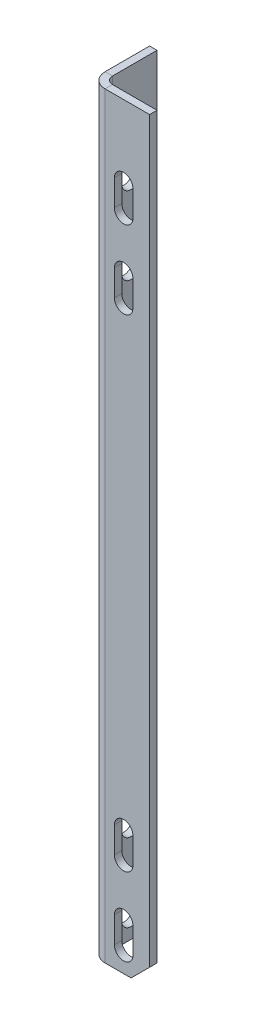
ISO-10303-21;
HEADER;
FILE_DESCRIPTION(('STEP AP214'),'2;1');
FILE_NAME('part.step','',(''),(''),'','','');
FILE_SCHEMA(('AUTOMOTIVE_DESIGN { 1 0 10303 214 1 1 1 1 }'));
ENDSEC;
DATA;
#1=APPLICATION_CONTEXT('core data for automotive mechanical design processes');
#2=APPLICATION_PROTOCOL_DEFINITION('international standard','automotive_design',2000,#1);
#3=PRODUCT_CONTEXT('',#1,'mechanical');
#4=PRODUCT('Part','Part','',(#3));
#5=PRODUCT_RELATED_PRODUCT_CATEGORY('part','',(#4));
#6=PRODUCT_DEFINITION_FORMATION('','',#4);
#7=PRODUCT_DEFINITION_CONTEXT('part definition',#1,'design');
#8=PRODUCT_DEFINITION('design','',#6,#7);
#9=PRODUCT_DEFINITION_SHAPE('','',#8);
#10=(LENGTH_UNIT() NAMED_UNIT(*) SI_UNIT(.MILLI.,.METRE.));
#11=(NAMED_UNIT(*) PLANE_ANGLE_UNIT() SI_UNIT($,.RADIAN.));
#12=(NAMED_UNIT(*) SI_UNIT($,.STERADIAN.) SOLID_ANGLE_UNIT());
#13=UNCERTAINTY_MEASURE_WITH_UNIT(LENGTH_MEASURE(1.E-05),#10,'distance_accuracy_value','');
#14=(GEOMETRIC_REPRESENTATION_CONTEXT(3) GLOBAL_UNCERTAINTY_ASSIGNED_CONTEXT((#13)) GLOBAL_UNIT_ASSIGNED_CONTEXT((#10,
#11,#12)) REPRESENTATION_CONTEXT('',''));
#15=CARTESIAN_POINT('',(0.,0.,0.));
#16=DIRECTION('',(0.,0.,1.));
#17=DIRECTION('',(1.,0.,0.));
#18=AXIS2_PLACEMENT_3D('',#15,#16,#17);
#19=CARTESIAN_POINT('',(0.,647.7,0.));
#20=DIRECTION('',(0.,0.,-1.));
#21=DIRECTION('',(-1.,0.,0.));
#22=AXIS2_PLACEMENT_3D('',#19,#20,#21);
#23=PLANE('',#22);
#24=CARTESIAN_POINT('',(28.575,496.8875,0.));
#25=DIRECTION('',(0.,0.,-1.));
#26=DIRECTION('',(-1.,0.,0.));
#27=AXIS2_PLACEMENT_3D('',#24,#25,#26);
#28=CIRCLE('',#27,7.9375);
#29=CARTESIAN_POINT('',(36.5125,496.8875,0.));
#30=VERTEX_POINT('',#29);
#31=CARTESIAN_POINT('',(20.6375,496.8875,0.));
#32=VERTEX_POINT('',#31);
#33=EDGE_CURVE('E455',#30,#32,#28,.T.);
#34=ORIENTED_EDGE('',*,*,#33,.T.);
#35=DIRECTION('',(0.,1.,0.));
#36=VECTOR('',#35,1.);
#37=CARTESIAN_POINT('',(20.6375,496.8875,0.));
#38=LINE('',#37,#36);
#39=CARTESIAN_POINT('',(20.6375,519.1125,0.));
#40=VERTEX_POINT('',#39);
#41=EDGE_CURVE('E458',#32,#40,#38,.T.);
#42=ORIENTED_EDGE('',*,*,#41,.T.);
#43=CARTESIAN_POINT('',(28.575,519.1125,0.));
#44=DIRECTION('',(0.,0.,-1.));
#45=DIRECTION('',(-1.,0.,0.));
#46=AXIS2_PLACEMENT_3D('',#43,#44,#45);
#47=CIRCLE('',#46,7.9375);
#48=CARTESIAN_POINT('',(36.5125,519.1125,0.));
#49=VERTEX_POINT('',#48);
#50=EDGE_CURVE('E461',#40,#49,#47,.T.);
#51=ORIENTED_EDGE('',*,*,#50,.T.);
#52=DIRECTION('',(0.,-1.,0.));
#53=VECTOR('',#52,1.);
#54=CARTESIAN_POINT('',(36.5125,496.8875,0.));
#55=LINE('',#54,#53);
#56=EDGE_CURVE('E464',#49,#30,#55,.T.);
#57=ORIENTED_EDGE('',*,*,#56,.T.);
#58=EDGE_LOOP('',(#34,#42,#51,#57));
#59=FACE_BOUND('',#58,.T.);
#60=CARTESIAN_POINT('',(28.575,84.1375,0.));
#61=DIRECTION('',(0.,0.,-1.));
#62=DIRECTION('',(-1.,0.,0.));
#63=AXIS2_PLACEMENT_3D('',#60,#61,#62);
#64=CIRCLE('',#63,7.9375);
#65=CARTESIAN_POINT('',(36.5125,84.1375000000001,0.));
#66=VERTEX_POINT('',#65);
#67=CARTESIAN_POINT('',(20.6375,84.1375,0.));
#68=VERTEX_POINT('',#67);
#69=EDGE_CURVE('E497',#66,#68,#64,.T.);
#70=ORIENTED_EDGE('',*,*,#69,.T.);
#71=DIRECTION('',(0.,1.,0.));
#72=VECTOR('',#71,1.);
#73=CARTESIAN_POINT('',(20.6375,84.1375,0.));
#74=LINE('',#73,#72);
#75=CARTESIAN_POINT('',(20.6375,106.3625,0.));
#76=VERTEX_POINT('',#75);
#77=EDGE_CURVE('E500',#68,#76,#74,.T.);
#78=ORIENTED_EDGE('',*,*,#77,.T.);
#79=CARTESIAN_POINT('',(28.575,106.3625,0.));
#80=DIRECTION('',(0.,0.,-1.));
#81=DIRECTION('',(-1.,0.,0.));
#82=AXIS2_PLACEMENT_3D('',#79,#80,#81);
#83=CIRCLE('',#82,7.9375);
#84=CARTESIAN_POINT('',(36.5125,106.3625,0.));
#85=VERTEX_POINT('',#84);
#86=EDGE_CURVE('E503',#76,#85,#83,.T.);
#87=ORIENTED_EDGE('',*,*,#86,.T.);
#88=DIRECTION('',(0.,-1.,0.));
#89=VECTOR('',#88,1.);
#90=CARTESIAN_POINT('',(36.5125,84.1375,0.));
#91=LINE('',#90,#89);
#92=EDGE_CURVE('E506',#85,#66,#91,.T.);
#93=ORIENTED_EDGE('',*,*,#92,.T.);
#94=EDGE_LOOP('',(#70,#78,#87,#93));
#95=FACE_BOUND('',#94,.T.);
#96=DIRECTION('',(1.,0.,0.));
#97=VECTOR('',#96,1.);
#98=CARTESIAN_POINT('',(0.,0.,0.));
#99=LINE('',#98,#97);
#100=CARTESIAN_POINT('',(12.7,0.,0.));
#101=VERTEX_POINT('',#100);
#102=CARTESIAN_POINT('',(34.925,0.,0.));
#103=VERTEX_POINT('',#102);
#104=EDGE_CURVE('E518',#101,#103,#99,.T.);
#105=ORIENTED_EDGE('',*,*,#104,.T.);
#106=DIRECTION('',(-0.707106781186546,-0.707106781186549,0.));
#107=VECTOR('',#106,1.);
#108=CARTESIAN_POINT('',(34.925,0.,0.));
#109=LINE('',#108,#107);
#110=CARTESIAN_POINT('',(50.8,15.8750000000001,0.));
#111=VERTEX_POINT('',#110);
#112=EDGE_CURVE('E639',#103,#111,#109,.F.);
#113=ORIENTED_EDGE('',*,*,#112,.T.);
#114=DIRECTION('',(0.,-1.,0.));
#115=VECTOR('',#114,1.);
#116=CARTESIAN_POINT('',(50.8,647.7,0.));
#117=LINE('',#116,#115);
#118=CARTESIAN_POINT('',(50.8,647.7,0.));
#119=VERTEX_POINT('',#118);
#120=EDGE_CURVE('E576',#119,#111,#117,.T.);
#121=ORIENTED_EDGE('',*,*,#120,.F.);
#122=DIRECTION('',(1.,0.,0.));
#123=VECTOR('',#122,1.);
#124=CARTESIAN_POINT('',(0.,647.7,0.));
#125=LINE('',#124,#123);
#126=CARTESIAN_POINT('',(12.7,647.7,0.));
#127=VERTEX_POINT('',#126);
#128=EDGE_CURVE('E519',#127,#119,#125,.T.);
#129=ORIENTED_EDGE('',*,*,#128,.F.);
#130=DIRECTION('',(0.,-1.,0.));
#131=VECTOR('',#130,1.);
#132=CARTESIAN_POINT('',(12.7,647.7,0.));
#133=LINE('',#132,#131);
#134=EDGE_CURVE('E543',#127,#101,#133,.T.);
#135=ORIENTED_EDGE('',*,*,#134,.T.);
#136=EDGE_LOOP('',(#105,#113,#121,#129,#135));
#137=FACE_BOUND('',#136,.T.);
#138=CARTESIAN_POINT('',(28.575,17.4625,0.));
#139=DIRECTION('',(0.,0.,-1.));
#140=DIRECTION('',(-1.,0.,0.));
#141=AXIS2_PLACEMENT_3D('',#138,#139,#140);
#142=CIRCLE('',#141,7.9375);
#143=CARTESIAN_POINT('',(36.5125,17.4625,0.));
#144=VERTEX_POINT('',#143);
#145=CARTESIAN_POINT('',(20.6375,17.4625,0.));
#146=VERTEX_POINT('',#145);
#147=EDGE_CURVE('E476',#144,#146,#142,.T.);
#148=ORIENTED_EDGE('',*,*,#147,.T.);
#149=DIRECTION('',(0.,1.,0.));
#150=VECTOR('',#149,1.);
#151=CARTESIAN_POINT('',(20.6375,17.4625,0.));
#152=LINE('',#151,#150);
#153=CARTESIAN_POINT('',(20.6375,39.6875,0.));
#154=VERTEX_POINT('',#153);
#155=EDGE_CURVE('E479',#146,#154,#152,.T.);
#156=ORIENTED_EDGE('',*,*,#155,.T.);
#157=CARTESIAN_POINT('',(28.575,39.6875,0.));
#158=DIRECTION('',(0.,0.,-1.));
#159=DIRECTION('',(-1.,0.,0.));
#160=AXIS2_PLACEMENT_3D('',#157,#158,#159);
#161=CIRCLE('',#160,7.9375);
#162=CARTESIAN_POINT('',(36.5125,39.6875,0.));
#163=VERTEX_POINT('',#162);
#164=EDGE_CURVE('E482',#154,#163,#161,.T.);
#165=ORIENTED_EDGE('',*,*,#164,.T.);
#166=DIRECTION('',(0.,-1.,0.));
#167=VECTOR('',#166,1.);
#168=CARTESIAN_POINT('',(36.5125,17.4625,0.));
#169=LINE('',#168,#167);
#170=EDGE_CURVE('E485',#163,#144,#169,.T.);
#171=ORIENTED_EDGE('',*,*,#170,.T.);
#172=EDGE_LOOP('',(#148,#156,#165,#171));
#173=FACE_BOUND('',#172,.T.);
#174=CARTESIAN_POINT('',(28.575,563.5625,0.));
#175=DIRECTION('',(0.,0.,-1.));
#176=DIRECTION('',(-1.,0.,0.));
#177=AXIS2_PLACEMENT_3D('',#174,#175,#176);
#178=CIRCLE('',#177,7.9375);
#179=CARTESIAN_POINT('',(36.5125,563.5625,0.));
#180=VERTEX_POINT('',#179);
#181=CARTESIAN_POINT('',(20.6375,563.5625,0.));
#182=VERTEX_POINT('',#181);
#183=EDGE_CURVE('E434',#180,#182,#178,.T.);
#184=ORIENTED_EDGE('',*,*,#183,.T.);
#185=DIRECTION('',(0.,1.,0.));
#186=VECTOR('',#185,1.);
#187=CARTESIAN_POINT('',(20.6375,563.5625,0.));
#188=LINE('',#187,#186);
#189=CARTESIAN_POINT('',(20.6375,585.7875,0.));
#190=VERTEX_POINT('',#189);
#191=EDGE_CURVE('E437',#182,#190,#188,.T.);
#192=ORIENTED_EDGE('',*,*,#191,.T.);
#193=CARTESIAN_POINT('',(28.575,585.7875,0.));
#194=DIRECTION('',(0.,0.,-1.));
#195=DIRECTION('',(-1.,0.,0.));
#196=AXIS2_PLACEMENT_3D('',#193,#194,#195);
#197=CIRCLE('',#196,7.9375);
#198=CARTESIAN_POINT('',(36.5125,585.7875,0.));
#199=VERTEX_POINT('',#198);
#200=EDGE_CURVE('E440',#190,#199,#197,.T.);
#201=ORIENTED_EDGE('',*,*,#200,.T.);
#202=DIRECTION('',(0.,-1.,0.));
#203=VECTOR('',#202,1.);
#204=CARTESIAN_POINT('',(36.5125,563.5625,0.));
#205=LINE('',#204,#203);
#206=EDGE_CURVE('E443',#199,#180,#205,.T.);
#207=ORIENTED_EDGE('',*,*,#206,.T.);
#208=EDGE_LOOP('',(#184,#192,#201,#207));
#209=FACE_BOUND('',#208,.T.);
#210=ADVANCED_FACE('F38',(#59,#95,#137,#173,#209),#23,.F.);
#211=CARTESIAN_POINT('',(0.,647.7,-6.35));
#212=DIRECTION('',(0.,0.,-1.));
#213=DIRECTION('',(-1.,0.,0.));
#214=AXIS2_PLACEMENT_3D('',#211,#212,#213);
#215=PLANE('',#214);
#216=DIRECTION('',(0.,-1.,0.));
#217=VECTOR('',#216,1.);
#218=CARTESIAN_POINT('',(20.6375,647.7,-6.35));
#219=LINE('',#218,#217);
#220=CARTESIAN_POINT('',(20.6375,519.1125,-6.35));
#221=VERTEX_POINT('',#220);
#222=CARTESIAN_POINT('',(20.6375,496.8875,-6.35));
#223=VERTEX_POINT('',#222);
#224=EDGE_CURVE('E618',#221,#223,#219,.T.);
#225=ORIENTED_EDGE('',*,*,#224,.T.);
#226=CARTESIAN_POINT('',(28.575,496.8875,-6.35));
#227=DIRECTION('',(0.,0.,-1.));
#228=DIRECTION('',(-1.,0.,0.));
#229=AXIS2_PLACEMENT_3D('',#226,#227,#228);
#230=CIRCLE('',#229,7.9375);
#231=CARTESIAN_POINT('',(36.5125,496.8875,-6.35));
#232=VERTEX_POINT('',#231);
#233=EDGE_CURVE('E621',#223,#232,#230,.F.);
#234=ORIENTED_EDGE('',*,*,#233,.T.);
#235=DIRECTION('',(0.,1.,0.));
#236=VECTOR('',#235,1.);
#237=CARTESIAN_POINT('',(36.5125,647.7,-6.35));
#238=LINE('',#237,#236);
#239=CARTESIAN_POINT('',(36.5125,519.1125,-6.35));
#240=VERTEX_POINT('',#239);
#241=EDGE_CURVE('E612',#232,#240,#238,.T.);
#242=ORIENTED_EDGE('',*,*,#241,.T.);
#243=CARTESIAN_POINT('',(28.575,519.1125,-6.35));
#244=DIRECTION('',(0.,0.,-1.));
#245=DIRECTION('',(-1.,0.,0.));
#246=AXIS2_PLACEMENT_3D('',#243,#244,#245);
#247=CIRCLE('',#246,7.9375);
#248=EDGE_CURVE('E615',#240,#221,#247,.F.);
#249=ORIENTED_EDGE('',*,*,#248,.T.);
#250=EDGE_LOOP('',(#225,#234,#242,#249));
#251=FACE_BOUND('',#250,.T.);
#252=DIRECTION('',(0.,-1.,0.));
#253=VECTOR('',#252,1.);
#254=CARTESIAN_POINT('',(20.6375,647.7,-6.35));
#255=LINE('',#254,#253);
#256=CARTESIAN_POINT('',(20.6375,106.3625,-6.35));
#257=VERTEX_POINT('',#256);
#258=CARTESIAN_POINT('',(20.6375,84.1375,-6.35));
#259=VERTEX_POINT('',#258);
#260=EDGE_CURVE('E594',#257,#259,#255,.T.);
#261=ORIENTED_EDGE('',*,*,#260,.T.);
#262=CARTESIAN_POINT('',(28.575,84.1375,-6.35));
#263=DIRECTION('',(0.,0.,-1.));
#264=DIRECTION('',(-1.,0.,0.));
#265=AXIS2_PLACEMENT_3D('',#262,#263,#264);
#266=CIRCLE('',#265,7.9375);
#267=CARTESIAN_POINT('',(36.5125,84.1375,-6.35));
#268=VERTEX_POINT('',#267);
#269=EDGE_CURVE('E597',#259,#268,#266,.F.);
#270=ORIENTED_EDGE('',*,*,#269,.T.);
#271=DIRECTION('',(0.,1.,0.));
#272=VECTOR('',#271,1.);
#273=CARTESIAN_POINT('',(36.5125,647.7,-6.35));
#274=LINE('',#273,#272);
#275=CARTESIAN_POINT('',(36.5125,106.3625,-6.35));
#276=VERTEX_POINT('',#275);
#277=EDGE_CURVE('E588',#268,#276,#274,.T.);
#278=ORIENTED_EDGE('',*,*,#277,.T.);
#279=CARTESIAN_POINT('',(28.575,106.3625,-6.35));
#280=DIRECTION('',(0.,0.,-1.));
#281=DIRECTION('',(-1.,0.,0.));
#282=AXIS2_PLACEMENT_3D('',#279,#280,#281);
#283=CIRCLE('',#282,7.9375);
#284=EDGE_CURVE('E591',#276,#257,#283,.F.);
#285=ORIENTED_EDGE('',*,*,#284,.T.);
#286=EDGE_LOOP('',(#261,#270,#278,#285));
#287=FACE_BOUND('',#286,.T.);
#288=DIRECTION('',(0.,-1.,0.));
#289=VECTOR('',#288,1.);
#290=CARTESIAN_POINT('',(50.8,647.7,-6.35));
#291=LINE('',#290,#289);
#292=CARTESIAN_POINT('',(50.8,647.7,-6.35));
#293=VERTEX_POINT('',#292);
#294=CARTESIAN_POINT('',(50.8,15.875,-6.35));
#295=VERTEX_POINT('',#294);
#296=EDGE_CURVE('E573',#293,#295,#291,.T.);
#297=ORIENTED_EDGE('',*,*,#296,.T.);
#298=DIRECTION('',(0.707106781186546,0.707106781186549,0.));
#299=VECTOR('',#298,1.);
#300=CARTESIAN_POINT('',(341.3125,306.387500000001,-6.35));
#301=LINE('',#300,#299);
#302=CARTESIAN_POINT('',(34.925,0.,-6.35));
#303=VERTEX_POINT('',#302);
#304=EDGE_CURVE('E643',#295,#303,#301,.F.);
#305=ORIENTED_EDGE('',*,*,#304,.T.);
#306=DIRECTION('',(1.,0.,0.));
#307=VECTOR('',#306,1.);
#308=CARTESIAN_POINT('',(0.,0.,-6.35));
#309=LINE('',#308,#307);
#310=CARTESIAN_POINT('',(12.7,0.,-6.35));
#311=VERTEX_POINT('',#310);
#312=EDGE_CURVE('E546',#311,#303,#309,.T.);
#313=ORIENTED_EDGE('',*,*,#312,.F.);
#314=DIRECTION('',(0.,-1.,0.));
#315=VECTOR('',#314,1.);
#316=CARTESIAN_POINT('',(12.7,647.7,-6.35));
#317=LINE('',#316,#315);
#318=CARTESIAN_POINT('',(12.7,647.7,-6.35));
#319=VERTEX_POINT('',#318);
#320=EDGE_CURVE('E570',#319,#311,#317,.T.);
#321=ORIENTED_EDGE('',*,*,#320,.F.);
#322=DIRECTION('',(1.,0.,0.));
#323=VECTOR('',#322,1.);
#324=CARTESIAN_POINT('',(0.,647.7,-6.35));
#325=LINE('',#324,#323);
#326=EDGE_CURVE('E525',#319,#293,#325,.T.);
#327=ORIENTED_EDGE('',*,*,#326,.T.);
#328=EDGE_LOOP('',(#297,#305,#313,#321,#327));
#329=FACE_BOUND('',#328,.T.);
#330=DIRECTION('',(0.,-1.,0.));
#331=VECTOR('',#330,1.);
#332=CARTESIAN_POINT('',(20.6375,647.7,-6.35));
#333=LINE('',#332,#331);
#334=CARTESIAN_POINT('',(20.6375,39.6875,-6.35));
#335=VERTEX_POINT('',#334);
#336=CARTESIAN_POINT('',(20.6375,17.4625,-6.35));
#337=VERTEX_POINT('',#336);
#338=EDGE_CURVE('E606',#335,#337,#333,.T.);
#339=ORIENTED_EDGE('',*,*,#338,.T.);
#340=CARTESIAN_POINT('',(28.575,17.4625,-6.35));
#341=DIRECTION('',(0.,0.,-1.));
#342=DIRECTION('',(-1.,0.,0.));
#343=AXIS2_PLACEMENT_3D('',#340,#341,#342);
#344=CIRCLE('',#343,7.9375);
#345=CARTESIAN_POINT('',(36.5125,17.4625,-6.35));
#346=VERTEX_POINT('',#345);
#347=EDGE_CURVE('E609',#337,#346,#344,.F.);
#348=ORIENTED_EDGE('',*,*,#347,.T.);
#349=DIRECTION('',(0.,1.,0.));
#350=VECTOR('',#349,1.);
#351=CARTESIAN_POINT('',(36.5125,647.7,-6.35));
#352=LINE('',#351,#350);
#353=CARTESIAN_POINT('',(36.5125,39.6875,-6.35));
#354=VERTEX_POINT('',#353);
#355=EDGE_CURVE('E600',#346,#354,#352,.T.);
#356=ORIENTED_EDGE('',*,*,#355,.T.);
#357=CARTESIAN_POINT('',(28.575,39.6875,-6.35));
#358=DIRECTION('',(0.,0.,-1.));
#359=DIRECTION('',(-1.,0.,0.));
#360=AXIS2_PLACEMENT_3D('',#357,#358,#359);
#361=CIRCLE('',#360,7.9375);
#362=EDGE_CURVE('E603',#354,#335,#361,.F.);
#363=ORIENTED_EDGE('',*,*,#362,.T.);
#364=EDGE_LOOP('',(#339,#348,#356,#363));
#365=FACE_BOUND('',#364,.T.);
#366=DIRECTION('',(0.,-1.,0.));
#367=VECTOR('',#366,1.);
#368=CARTESIAN_POINT('',(20.6375,647.7,-6.35));
#369=LINE('',#368,#367);
#370=CARTESIAN_POINT('',(20.6375,585.7875,-6.35));
#371=VERTEX_POINT('',#370);
#372=CARTESIAN_POINT('',(20.6375,563.5625,-6.35));
#373=VERTEX_POINT('',#372);
#374=EDGE_CURVE('E630',#371,#373,#369,.T.);
#375=ORIENTED_EDGE('',*,*,#374,.T.);
#376=CARTESIAN_POINT('',(28.575,563.5625,-6.35));
#377=DIRECTION('',(0.,0.,-1.));
#378=DIRECTION('',(-1.,0.,0.));
#379=AXIS2_PLACEMENT_3D('',#376,#377,#378);
#380=CIRCLE('',#379,7.9375);
#381=CARTESIAN_POINT('',(36.5125,563.5625,-6.35));
#382=VERTEX_POINT('',#381);
#383=EDGE_CURVE('E633',#373,#382,#380,.F.);
#384=ORIENTED_EDGE('',*,*,#383,.T.);
#385=DIRECTION('',(0.,1.,0.));
#386=VECTOR('',#385,1.);
#387=CARTESIAN_POINT('',(36.5125,647.7,-6.35));
#388=LINE('',#387,#386);
#389=CARTESIAN_POINT('',(36.5125,585.7875,-6.35));
#390=VERTEX_POINT('',#389);
#391=EDGE_CURVE('E624',#382,#390,#388,.T.);
#392=ORIENTED_EDGE('',*,*,#391,.T.);
#393=CARTESIAN_POINT('',(28.575,585.7875,-6.35));
#394=DIRECTION('',(0.,0.,-1.));
#395=DIRECTION('',(-1.,0.,0.));
#396=AXIS2_PLACEMENT_3D('',#393,#394,#395);
#397=CIRCLE('',#396,7.9375);
#398=EDGE_CURVE('E627',#390,#371,#397,.F.);
#399=ORIENTED_EDGE('',*,*,#398,.T.);
#400=EDGE_LOOP('',(#375,#384,#392,#399));
#401=FACE_BOUND('',#400,.T.);
#402=ADVANCED_FACE('F682',(#251,#287,#329,#365,#401),#215,.T.);
#403=CARTESIAN_POINT('',(0.,647.7,-12.7));
#404=DIRECTION('',(0.,1.,0.));
#405=DIRECTION('',(0.,0.,1.));
#406=AXIS2_PLACEMENT_3D('',#403,#404,#405);
#407=PLANE('',#406);
#408=DIRECTION('',(1.,0.,0.));
#409=VECTOR('',#408,1.);
#410=CARTESIAN_POINT('',(0.,647.7,-12.7));
#411=LINE('',#410,#409);
#412=CARTESIAN_POINT('',(0.,647.7,-12.7));
#413=VERTEX_POINT('',#412);
#414=CARTESIAN_POINT('',(6.35,647.7,-12.7));
#415=VERTEX_POINT('',#414);
#416=EDGE_CURVE('E586',#413,#415,#411,.T.);
#417=ORIENTED_EDGE('',*,*,#416,.F.);
#418=CARTESIAN_POINT('',(12.7,647.7,-12.7));
#419=DIRECTION('',(0.,-1.,0.));
#420=DIRECTION('',(0.,0.,-1.));
#421=AXIS2_PLACEMENT_3D('',#418,#419,#420);
#422=CIRCLE('',#421,12.7);
#423=EDGE_CURVE('E540',#413,#127,#422,.F.);
#424=ORIENTED_EDGE('',*,*,#423,.T.);
#425=DIRECTION('',(0.,0.,1.));
#426=VECTOR('',#425,1.);
#427=CARTESIAN_POINT('',(12.7,647.7,-6.35));
#428=LINE('',#427,#426);
#429=EDGE_CURVE('E584',#319,#127,#428,.T.);
#430=ORIENTED_EDGE('',*,*,#429,.F.);
#431=CARTESIAN_POINT('',(12.7,647.7,-12.7));
#432=DIRECTION('',(0.,1.,0.));
#433=DIRECTION('',(1.,0.,0.));
#434=AXIS2_PLACEMENT_3D('',#431,#432,#433);
#435=CIRCLE('',#434,6.35);
#436=EDGE_CURVE('E528',#415,#319,#435,.T.);
#437=ORIENTED_EDGE('',*,*,#436,.F.);
#438=EDGE_LOOP('',(#417,#424,#430,#437));
#439=FACE_BOUND('',#438,.T.);
#440=ADVANCED_FACE('F688',(#439),#407,.T.);
#441=CARTESIAN_POINT('',(12.7,647.7,-6.35));
#442=DIRECTION('',(0.,1.,0.));
#443=DIRECTION('',(0.,0.,1.));
#444=AXIS2_PLACEMENT_3D('',#441,#442,#443);
#445=PLANE('',#444);
#446=DIRECTION('',(0.,0.,1.));
#447=VECTOR('',#446,1.);
#448=CARTESIAN_POINT('',(0.,647.7,0.));
#449=LINE('',#448,#447);
#450=CARTESIAN_POINT('',(0.,647.7,-50.8));
#451=VERTEX_POINT('',#450);
#452=EDGE_CURVE('E537',#451,#413,#449,.T.);
#453=ORIENTED_EDGE('',*,*,#452,.T.);
#454=ORIENTED_EDGE('',*,*,#416,.T.);
#455=DIRECTION('',(0.,0.,-1.));
#456=VECTOR('',#455,1.);
#457=CARTESIAN_POINT('',(6.35,647.7,0.));
#458=LINE('',#457,#456);
#459=CARTESIAN_POINT('',(6.35,647.7,-50.8));
#460=VERTEX_POINT('',#459);
#461=EDGE_CURVE('E531',#460,#415,#458,.F.);
#462=ORIENTED_EDGE('',*,*,#461,.F.);
#463=DIRECTION('',(1.,0.,0.));
#464=VECTOR('',#463,1.);
#465=CARTESIAN_POINT('',(0.,647.7,-50.8));
#466=LINE('',#465,#464);
#467=EDGE_CURVE('E534',#451,#460,#466,.T.);
#468=ORIENTED_EDGE('',*,*,#467,.F.);
#469=EDGE_LOOP('',(#453,#454,#462,#468));
#470=FACE_BOUND('',#469,.T.);
#471=ADVANCED_FACE('F701',(#470),#445,.T.);
#472=CARTESIAN_POINT('',(12.7,0.,0.));
#473=DIRECTION('',(0.,-1.,0.));
#474=DIRECTION('',(0.,0.,-1.));
#475=AXIS2_PLACEMENT_3D('',#472,#473,#474);
#476=PLANE('',#475);
#477=DIRECTION('',(0.,0.,-1.));
#478=VECTOR('',#477,1.);
#479=CARTESIAN_POINT('',(12.7,0.,0.));
#480=LINE('',#479,#478);
#481=EDGE_CURVE('E582',#101,#311,#480,.T.);
#482=ORIENTED_EDGE('',*,*,#481,.F.);
#483=CARTESIAN_POINT('',(12.7,0.,-12.7));
#484=DIRECTION('',(0.,-1.,0.));
#485=DIRECTION('',(0.,0.,-1.));
#486=AXIS2_PLACEMENT_3D('',#483,#484,#485);
#487=CIRCLE('',#486,12.7);
#488=CARTESIAN_POINT('',(0.,0.,-12.7));
#489=VERTEX_POINT('',#488);
#490=EDGE_CURVE('E522',#489,#101,#487,.F.);
#491=ORIENTED_EDGE('',*,*,#490,.F.);
#492=DIRECTION('',(-1.,0.,0.));
#493=VECTOR('',#492,1.);
#494=CARTESIAN_POINT('',(6.35,0.,-12.7));
#495=LINE('',#494,#493);
#496=CARTESIAN_POINT('',(6.35,0.,-12.7));
#497=VERTEX_POINT('',#496);
#498=EDGE_CURVE('E579',#497,#489,#495,.T.);
#499=ORIENTED_EDGE('',*,*,#498,.F.);
#500=CARTESIAN_POINT('',(12.7,0.,-12.7));
#501=DIRECTION('',(0.,1.,0.));
#502=DIRECTION('',(1.,0.,0.));
#503=AXIS2_PLACEMENT_3D('',#500,#501,#502);
#504=CIRCLE('',#503,6.35);
#505=EDGE_CURVE('E549',#497,#311,#504,.T.);
#506=ORIENTED_EDGE('',*,*,#505,.T.);
#507=EDGE_LOOP('',(#482,#491,#499,#506));
#508=FACE_BOUND('',#507,.T.);
#509=ADVANCED_FACE('F665',(#508),#476,.T.);
#510=CARTESIAN_POINT('',(6.35,0.,-12.7));
#511=DIRECTION('',(0.,-1.,0.));
#512=DIRECTION('',(0.,0.,-1.));
#513=AXIS2_PLACEMENT_3D('',#510,#511,#512);
#514=PLANE('',#513);
#515=ORIENTED_EDGE('',*,*,#312,.T.);
#516=DIRECTION('',(0.,0.,1.));
#517=VECTOR('',#516,1.);
#518=CARTESIAN_POINT('',(34.925,0.,-12.7));
#519=LINE('',#518,#517);
#520=EDGE_CURVE('E636',#303,#103,#519,.T.);
#521=ORIENTED_EDGE('',*,*,#520,.T.);
#522=ORIENTED_EDGE('',*,*,#104,.F.);
#523=ORIENTED_EDGE('',*,*,#481,.T.);
#524=EDGE_LOOP('',(#515,#521,#522,#523));
#525=FACE_BOUND('',#524,.T.);
#526=ADVANCED_FACE('F695',(#525),#514,.T.);
#527=CARTESIAN_POINT('',(50.8,647.7,-6.35));
#528=DIRECTION('',(1.,0.,0.));
#529=DIRECTION('',(0.,0.,-1.));
#530=AXIS2_PLACEMENT_3D('',#527,#528,#529);
#531=PLANE('',#530);
#532=ORIENTED_EDGE('',*,*,#120,.T.);
#533=DIRECTION('',(0.,0.,-1.));
#534=VECTOR('',#533,1.);
#535=CARTESIAN_POINT('',(50.8,15.8750000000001,-6.35));
#536=LINE('',#535,#534);
#537=EDGE_CURVE('E641',#111,#295,#536,.T.);
#538=ORIENTED_EDGE('',*,*,#537,.T.);
#539=ORIENTED_EDGE('',*,*,#296,.F.);
#540=DIRECTION('',(0.,0.,1.));
#541=VECTOR('',#540,1.);
#542=CARTESIAN_POINT('',(50.8,647.7,-6.35));
#543=LINE('',#542,#541);
#544=EDGE_CURVE('E521',#293,#119,#543,.T.);
#545=ORIENTED_EDGE('',*,*,#544,.T.);
#546=EDGE_LOOP('',(#532,#538,#539,#545));
#547=FACE_BOUND('',#546,.T.);
#548=ADVANCED_FACE('F694',(#547),#531,.T.);
#549=CARTESIAN_POINT('',(12.7,647.7,-12.7));
#550=DIRECTION('',(0.,-1.,0.));
#551=DIRECTION('',(0.,0.,-1.));
#552=AXIS2_PLACEMENT_3D('',#549,#550,#551);
#553=CYLINDRICAL_SURFACE('',#552,6.35);
#554=ORIENTED_EDGE('',*,*,#505,.F.);
#555=DIRECTION('',(0.,-1.,0.));
#556=VECTOR('',#555,1.);
#557=CARTESIAN_POINT('',(6.35,647.7,-12.7));
#558=LINE('',#557,#556);
#559=EDGE_CURVE('E567',#415,#497,#558,.T.);
#560=ORIENTED_EDGE('',*,*,#559,.F.);
#561=ORIENTED_EDGE('',*,*,#436,.T.);
#562=ORIENTED_EDGE('',*,*,#320,.T.);
#563=EDGE_LOOP('',(#554,#560,#561,#562));
#564=FACE_BOUND('',#563,.T.);
#565=ADVANCED_FACE('F661',(#564),#553,.F.);
#566=CARTESIAN_POINT('',(6.35,647.7,0.));
#567=DIRECTION('',(1.,0.,0.));
#568=DIRECTION('',(0.,0.,-1.));
#569=AXIS2_PLACEMENT_3D('',#566,#567,#568);
#570=PLANE('',#569);
#571=CARTESIAN_POINT('',(6.35,519.1125,-28.575));
#572=DIRECTION('',(1.,0.,0.));
#573=DIRECTION('',(0.,0.,-1.));
#574=AXIS2_PLACEMENT_3D('',#571,#572,#573);
#575=CIRCLE('',#574,7.93750000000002);
#576=CARTESIAN_POINT('',(6.35,519.1125,-36.5125));
#577=VERTEX_POINT('',#576);
#578=CARTESIAN_POINT('',(6.35,519.1125,-20.6375));
#579=VERTEX_POINT('',#578);
#580=EDGE_CURVE('E345',#577,#579,#575,.T.);
#581=ORIENTED_EDGE('',*,*,#580,.F.);
#582=DIRECTION('',(0.,1.,0.));
#583=VECTOR('',#582,1.);
#584=CARTESIAN_POINT('',(6.35,647.7,-36.5125000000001));
#585=LINE('',#584,#583);
#586=CARTESIAN_POINT('',(6.35,496.8875,-36.5125));
#587=VERTEX_POINT('',#586);
#588=EDGE_CURVE('E338',#587,#577,#585,.T.);
#589=ORIENTED_EDGE('',*,*,#588,.F.);
#590=CARTESIAN_POINT('',(6.35,496.8875,-28.575));
#591=DIRECTION('',(1.,0.,0.));
#592=DIRECTION('',(0.,0.,-1.));
#593=AXIS2_PLACEMENT_3D('',#590,#591,#592);
#594=CIRCLE('',#593,7.9375);
#595=CARTESIAN_POINT('',(6.35,496.8875,-20.6375));
#596=VERTEX_POINT('',#595);
#597=EDGE_CURVE('E313',#596,#587,#594,.T.);
#598=ORIENTED_EDGE('',*,*,#597,.F.);
#599=DIRECTION('',(0.,-1.,0.));
#600=VECTOR('',#599,1.);
#601=CARTESIAN_POINT('',(6.35,647.7,-20.6374999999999));
#602=LINE('',#601,#600);
#603=EDGE_CURVE('E343',#579,#596,#602,.T.);
#604=ORIENTED_EDGE('',*,*,#603,.F.);
#605=EDGE_LOOP('',(#581,#589,#598,#604));
#606=FACE_BOUND('',#605,.T.);
#607=CARTESIAN_POINT('',(6.35,585.7875,-28.575));
#608=DIRECTION('',(1.,0.,0.));
#609=DIRECTION('',(0.,0.,-1.));
#610=AXIS2_PLACEMENT_3D('',#607,#608,#609);
#611=CIRCLE('',#610,7.93750000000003);
#612=CARTESIAN_POINT('',(6.35,585.7875,-36.5125));
#613=VERTEX_POINT('',#612);
#614=CARTESIAN_POINT('',(6.35,585.7875,-20.6375));
#615=VERTEX_POINT('',#614);
#616=EDGE_CURVE('E374',#613,#615,#611,.T.);
#617=ORIENTED_EDGE('',*,*,#616,.F.);
#618=DIRECTION('',(0.,1.,0.));
#619=VECTOR('',#618,1.);
#620=CARTESIAN_POINT('',(6.35,647.7,-36.5125000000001));
#621=LINE('',#620,#619);
#622=CARTESIAN_POINT('',(6.35,563.5625,-36.5125));
#623=VERTEX_POINT('',#622);
#624=EDGE_CURVE('E361',#623,#613,#621,.T.);
#625=ORIENTED_EDGE('',*,*,#624,.F.);
#626=CARTESIAN_POINT('',(6.35,563.5625,-28.575));
#627=DIRECTION('',(1.,0.,0.));
#628=DIRECTION('',(0.,0.,-1.));
#629=AXIS2_PLACEMENT_3D('',#626,#627,#628);
#630=CIRCLE('',#629,7.93750000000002);
#631=CARTESIAN_POINT('',(6.35,563.5625,-20.6375));
#632=VERTEX_POINT('',#631);
#633=EDGE_CURVE('E369',#632,#623,#630,.T.);
#634=ORIENTED_EDGE('',*,*,#633,.F.);
#635=DIRECTION('',(0.,-1.,0.));
#636=VECTOR('',#635,1.);
#637=CARTESIAN_POINT('',(6.35,647.7,-20.6374999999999));
#638=LINE('',#637,#636);
#639=EDGE_CURVE('E372',#615,#632,#638,.T.);
#640=ORIENTED_EDGE('',*,*,#639,.F.);
#641=EDGE_LOOP('',(#617,#625,#634,#640));
#642=FACE_BOUND('',#641,.T.);
#643=CARTESIAN_POINT('',(6.35,84.1375,-28.575));
#644=DIRECTION('',(1.,0.,0.));
#645=DIRECTION('',(0.,0.,-1.));
#646=AXIS2_PLACEMENT_3D('',#643,#644,#645);
#647=CIRCLE('',#646,7.9375);
#648=CARTESIAN_POINT('',(6.35,84.1374999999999,-20.6375));
#649=VERTEX_POINT('',#648);
#650=CARTESIAN_POINT('',(6.35,84.1374999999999,-36.5125));
#651=VERTEX_POINT('',#650);
#652=EDGE_CURVE('E403',#649,#651,#647,.T.);
#653=ORIENTED_EDGE('',*,*,#652,.F.);
#654=DIRECTION('',(0.,-1.,0.));
#655=VECTOR('',#654,1.);
#656=CARTESIAN_POINT('',(6.35,647.7,-20.6375));
#657=LINE('',#656,#655);
#658=CARTESIAN_POINT('',(6.35,106.3625,-20.6375));
#659=VERTEX_POINT('',#658);
#660=EDGE_CURVE('E390',#659,#649,#657,.T.);
#661=ORIENTED_EDGE('',*,*,#660,.F.);
#662=CARTESIAN_POINT('',(6.35,106.3625,-28.5749999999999));
#663=DIRECTION('',(1.,0.,0.));
#664=DIRECTION('',(0.,0.,-1.));
#665=AXIS2_PLACEMENT_3D('',#662,#663,#664);
#666=CIRCLE('',#665,7.9375);
#667=CARTESIAN_POINT('',(6.35,106.3625,-36.5125));
#668=VERTEX_POINT('',#667);
#669=EDGE_CURVE('E398',#668,#659,#666,.T.);
#670=ORIENTED_EDGE('',*,*,#669,.F.);
#671=DIRECTION('',(0.,1.,0.));
#672=VECTOR('',#671,1.);
#673=CARTESIAN_POINT('',(6.35,647.7,-36.5125));
#674=LINE('',#673,#672);
#675=EDGE_CURVE('E401',#651,#668,#674,.T.);
#676=ORIENTED_EDGE('',*,*,#675,.F.);
#677=EDGE_LOOP('',(#653,#661,#670,#676));
#678=FACE_BOUND('',#677,.T.);
#679=CARTESIAN_POINT('',(6.35,17.4625,-28.575));
#680=DIRECTION('',(1.,0.,0.));
#681=DIRECTION('',(0.,0.,-1.));
#682=AXIS2_PLACEMENT_3D('',#679,#680,#681);
#683=CIRCLE('',#682,7.9375);
#684=CARTESIAN_POINT('',(6.35,17.4625,-20.6375));
#685=VERTEX_POINT('',#684);
#686=CARTESIAN_POINT('',(6.35,17.4625,-36.5125));
#687=VERTEX_POINT('',#686);
#688=EDGE_CURVE('E432',#685,#687,#683,.T.);
#689=ORIENTED_EDGE('',*,*,#688,.F.);
#690=DIRECTION('',(0.,-1.,0.));
#691=VECTOR('',#690,1.);
#692=CARTESIAN_POINT('',(6.35,647.7,-20.6375));
#693=LINE('',#692,#691);
#694=CARTESIAN_POINT('',(6.35,39.6875,-20.6375));
#695=VERTEX_POINT('',#694);
#696=EDGE_CURVE('E419',#695,#685,#693,.T.);
#697=ORIENTED_EDGE('',*,*,#696,.F.);
#698=CARTESIAN_POINT('',(6.35,39.6875,-28.575));
#699=DIRECTION('',(1.,0.,0.));
#700=DIRECTION('',(0.,0.,-1.));
#701=AXIS2_PLACEMENT_3D('',#698,#699,#700);
#702=CIRCLE('',#701,7.9375);
#703=CARTESIAN_POINT('',(6.35,39.6875,-36.5125));
#704=VERTEX_POINT('',#703);
#705=EDGE_CURVE('E427',#704,#695,#702,.T.);
#706=ORIENTED_EDGE('',*,*,#705,.F.);
#707=DIRECTION('',(0.,1.,0.));
#708=VECTOR('',#707,1.);
#709=CARTESIAN_POINT('',(6.35,647.7,-36.5125));
#710=LINE('',#709,#708);
#711=EDGE_CURVE('E430',#687,#704,#710,.T.);
#712=ORIENTED_EDGE('',*,*,#711,.F.);
#713=EDGE_LOOP('',(#689,#697,#706,#712));
#714=FACE_BOUND('',#713,.T.);
#715=DIRECTION('',(0.,0.,-1.));
#716=VECTOR('',#715,1.);
#717=CARTESIAN_POINT('',(6.35,0.,0.));
#718=LINE('',#717,#716);
#719=CARTESIAN_POINT('',(6.35,0.,-34.925));
#720=VERTEX_POINT('',#719);
#721=EDGE_CURVE('E552',#720,#497,#718,.F.);
#722=ORIENTED_EDGE('',*,*,#721,.F.);
#723=DIRECTION('',(0.,0.707106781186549,-0.707106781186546));
#724=VECTOR('',#723,1.);
#725=CARTESIAN_POINT('',(6.35,306.387500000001,-341.3125));
#726=LINE('',#725,#724);
#727=CARTESIAN_POINT('',(6.35,15.8750000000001,-50.8));
#728=VERTEX_POINT('',#727);
#729=EDGE_CURVE('E60',#720,#728,#726,.T.);
#730=ORIENTED_EDGE('',*,*,#729,.T.);
#731=DIRECTION('',(0.,-1.,0.));
#732=VECTOR('',#731,1.);
#733=CARTESIAN_POINT('',(6.35,647.7,-50.8));
#734=LINE('',#733,#732);
#735=EDGE_CURVE('E565',#460,#728,#734,.T.);
#736=ORIENTED_EDGE('',*,*,#735,.F.);
#737=ORIENTED_EDGE('',*,*,#461,.T.);
#738=ORIENTED_EDGE('',*,*,#559,.T.);
#739=EDGE_LOOP('',(#722,#730,#736,#737,#738));
#740=FACE_BOUND('',#739,.T.);
#741=ADVANCED_FACE('F655',(#606,#642,#678,#714,#740),#570,.T.);
#742=CARTESIAN_POINT('',(0.,647.7,-50.8));
#743=DIRECTION('',(0.,0.,-1.));
#744=DIRECTION('',(-1.,0.,0.));
#745=AXIS2_PLACEMENT_3D('',#742,#743,#744);
#746=PLANE('',#745);
#747=ORIENTED_EDGE('',*,*,#735,.T.);
#748=DIRECTION('',(-1.,0.,0.));
#749=VECTOR('',#748,1.);
#750=CARTESIAN_POINT('',(0.,15.8750000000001,-50.8));
#751=LINE('',#750,#749);
#752=CARTESIAN_POINT('',(0.,15.875,-50.8));
#753=VERTEX_POINT('',#752);
#754=EDGE_CURVE('E46',#728,#753,#751,.T.);
#755=ORIENTED_EDGE('',*,*,#754,.T.);
#756=DIRECTION('',(0.,-1.,0.));
#757=VECTOR('',#756,1.);
#758=CARTESIAN_POINT('',(0.,647.7,-50.8));
#759=LINE('',#758,#757);
#760=EDGE_CURVE('E563',#451,#753,#759,.T.);
#761=ORIENTED_EDGE('',*,*,#760,.F.);
#762=ORIENTED_EDGE('',*,*,#467,.T.);
#763=EDGE_LOOP('',(#747,#755,#761,#762));
#764=FACE_BOUND('',#763,.T.);
#765=ADVANCED_FACE('F709',(#764),#746,.T.);
#766=CARTESIAN_POINT('',(0.,647.7,0.));
#767=DIRECTION('',(1.,0.,0.));
#768=DIRECTION('',(0.,0.,-1.));
#769=AXIS2_PLACEMENT_3D('',#766,#767,#768);
#770=PLANE('',#769);
#771=DIRECTION('',(0.,-1.,0.));
#772=VECTOR('',#771,1.);
#773=CARTESIAN_POINT('',(0.,519.1125,-36.5125));
#774=LINE('',#773,#772);
#775=CARTESIAN_POINT('',(0.,519.1125,-36.5125));
#776=VERTEX_POINT('',#775);
#777=CARTESIAN_POINT('',(0.,496.8875,-36.5125));
#778=VERTEX_POINT('',#777);
#779=EDGE_CURVE('E321',#776,#778,#774,.T.);
#780=ORIENTED_EDGE('',*,*,#779,.F.);
#781=CARTESIAN_POINT('',(0.,519.1125,-28.575));
#782=DIRECTION('',(-1.,0.,0.));
#783=DIRECTION('',(0.,0.,1.));
#784=AXIS2_PLACEMENT_3D('',#781,#782,#783);
#785=CIRCLE('',#784,7.93750000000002);
#786=CARTESIAN_POINT('',(0.,519.1125,-20.6375));
#787=VERTEX_POINT('',#786);
#788=EDGE_CURVE('E326',#787,#776,#785,.T.);
#789=ORIENTED_EDGE('',*,*,#788,.F.);
#790=DIRECTION('',(0.,1.,0.));
#791=VECTOR('',#790,1.);
#792=CARTESIAN_POINT('',(0.,519.1125,-20.6375));
#793=LINE('',#792,#791);
#794=CARTESIAN_POINT('',(0.,496.8875,-20.6375));
#795=VERTEX_POINT('',#794);
#796=EDGE_CURVE('E331',#795,#787,#793,.T.);
#797=ORIENTED_EDGE('',*,*,#796,.F.);
#798=CARTESIAN_POINT('',(0.,496.8875,-28.575));
#799=DIRECTION('',(-1.,0.,0.));
#800=DIRECTION('',(0.,0.,1.));
#801=AXIS2_PLACEMENT_3D('',#798,#799,#800);
#802=CIRCLE('',#801,7.9375);
#803=EDGE_CURVE('E310',#778,#795,#802,.T.);
#804=ORIENTED_EDGE('',*,*,#803,.F.);
#805=EDGE_LOOP('',(#780,#789,#797,#804));
#806=FACE_BOUND('',#805,.T.);
#807=DIRECTION('',(0.,-1.,0.));
#808=VECTOR('',#807,1.);
#809=CARTESIAN_POINT('',(0.,585.7875,-36.5125));
#810=LINE('',#809,#808);
#811=CARTESIAN_POINT('',(0.,585.7875,-36.5125));
#812=VERTEX_POINT('',#811);
#813=CARTESIAN_POINT('',(0.,563.5625,-36.5125));
#814=VERTEX_POINT('',#813);
#815=EDGE_CURVE('E349',#812,#814,#810,.T.);
#816=ORIENTED_EDGE('',*,*,#815,.F.);
#817=CARTESIAN_POINT('',(0.,585.7875,-28.575));
#818=DIRECTION('',(-1.,0.,0.));
#819=DIRECTION('',(0.,0.,1.));
#820=AXIS2_PLACEMENT_3D('',#817,#818,#819);
#821=CIRCLE('',#820,7.93750000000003);
#822=CARTESIAN_POINT('',(0.,585.7875,-20.6375));
#823=VERTEX_POINT('',#822);
#824=EDGE_CURVE('E347',#823,#812,#821,.T.);
#825=ORIENTED_EDGE('',*,*,#824,.F.);
#826=DIRECTION('',(0.,1.,0.));
#827=VECTOR('',#826,1.);
#828=CARTESIAN_POINT('',(0.,585.7875,-20.6375));
#829=LINE('',#828,#827);
#830=CARTESIAN_POINT('',(0.,563.5625,-20.6375));
#831=VERTEX_POINT('',#830);
#832=EDGE_CURVE('E355',#831,#823,#829,.T.);
#833=ORIENTED_EDGE('',*,*,#832,.F.);
#834=CARTESIAN_POINT('',(0.,563.5625,-28.575));
#835=DIRECTION('',(-1.,0.,0.));
#836=DIRECTION('',(0.,0.,1.));
#837=AXIS2_PLACEMENT_3D('',#834,#835,#836);
#838=CIRCLE('',#837,7.93750000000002);
#839=EDGE_CURVE('E352',#814,#831,#838,.T.);
#840=ORIENTED_EDGE('',*,*,#839,.F.);
#841=EDGE_LOOP('',(#816,#825,#833,#840));
#842=FACE_BOUND('',#841,.T.);
#843=DIRECTION('',(0.,1.,0.));
#844=VECTOR('',#843,1.);
#845=CARTESIAN_POINT('',(0.,84.1374999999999,-20.6375));
#846=LINE('',#845,#844);
#847=CARTESIAN_POINT('',(0.,84.1375,-20.6375));
#848=VERTEX_POINT('',#847);
#849=CARTESIAN_POINT('',(0.,106.3625,-20.6374999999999));
#850=VERTEX_POINT('',#849);
#851=EDGE_CURVE('E378',#848,#850,#846,.T.);
#852=ORIENTED_EDGE('',*,*,#851,.F.);
#853=CARTESIAN_POINT('',(0.,84.1375,-28.575));
#854=DIRECTION('',(-1.,0.,0.));
#855=DIRECTION('',(0.,0.,1.));
#856=AXIS2_PLACEMENT_3D('',#853,#854,#855);
#857=CIRCLE('',#856,7.9375);
#858=CARTESIAN_POINT('',(0.,84.1374999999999,-36.5125));
#859=VERTEX_POINT('',#858);
#860=EDGE_CURVE('E376',#859,#848,#857,.T.);
#861=ORIENTED_EDGE('',*,*,#860,.F.);
#862=DIRECTION('',(0.,-1.,0.));
#863=VECTOR('',#862,1.);
#864=CARTESIAN_POINT('',(0.,84.1374999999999,-36.5125));
#865=LINE('',#864,#863);
#866=CARTESIAN_POINT('',(0.,106.3625,-36.5125));
#867=VERTEX_POINT('',#866);
#868=EDGE_CURVE('E384',#867,#859,#865,.T.);
#869=ORIENTED_EDGE('',*,*,#868,.F.);
#870=CARTESIAN_POINT('',(0.,106.3625,-28.5749999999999));
#871=DIRECTION('',(-1.,0.,0.));
#872=DIRECTION('',(0.,0.,1.));
#873=AXIS2_PLACEMENT_3D('',#870,#871,#872);
#874=CIRCLE('',#873,7.9375);
#875=EDGE_CURVE('E381',#850,#867,#874,.T.);
#876=ORIENTED_EDGE('',*,*,#875,.F.);
#877=EDGE_LOOP('',(#852,#861,#869,#876));
#878=FACE_BOUND('',#877,.T.);
#879=DIRECTION('',(0.,1.,0.));
#880=VECTOR('',#879,1.);
#881=CARTESIAN_POINT('',(0.,17.4625,-20.6375));
#882=LINE('',#881,#880);
#883=CARTESIAN_POINT('',(0.,17.4625,-20.6375));
#884=VERTEX_POINT('',#883);
#885=CARTESIAN_POINT('',(0.,39.6875,-20.6375));
#886=VERTEX_POINT('',#885);
#887=EDGE_CURVE('E407',#884,#886,#882,.T.);
#888=ORIENTED_EDGE('',*,*,#887,.F.);
#889=CARTESIAN_POINT('',(0.,17.4625,-28.575));
#890=DIRECTION('',(-1.,0.,0.));
#891=DIRECTION('',(0.,0.,1.));
#892=AXIS2_PLACEMENT_3D('',#889,#890,#891);
#893=CIRCLE('',#892,7.9375);
#894=CARTESIAN_POINT('',(0.,17.4625,-36.5125));
#895=VERTEX_POINT('',#894);
#896=EDGE_CURVE('E405',#895,#884,#893,.T.);
#897=ORIENTED_EDGE('',*,*,#896,.F.);
#898=DIRECTION('',(0.,-1.,0.));
#899=VECTOR('',#898,1.);
#900=CARTESIAN_POINT('',(0.,17.4625,-36.5125));
#901=LINE('',#900,#899);
#902=CARTESIAN_POINT('',(0.,39.6875,-36.5125));
#903=VERTEX_POINT('',#902);
#904=EDGE_CURVE('E413',#903,#895,#901,.T.);
#905=ORIENTED_EDGE('',*,*,#904,.F.);
#906=CARTESIAN_POINT('',(0.,39.6875,-28.575));
#907=DIRECTION('',(-1.,0.,0.));
#908=DIRECTION('',(0.,0.,1.));
#909=AXIS2_PLACEMENT_3D('',#906,#907,#908);
#910=CIRCLE('',#909,7.9375);
#911=EDGE_CURVE('E410',#886,#903,#910,.T.);
#912=ORIENTED_EDGE('',*,*,#911,.F.);
#913=EDGE_LOOP('',(#888,#897,#905,#912));
#914=FACE_BOUND('',#913,.T.);
#915=ORIENTED_EDGE('',*,*,#760,.T.);
#916=DIRECTION('',(0.,-0.707106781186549,0.707106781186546));
#917=VECTOR('',#916,1.);
#918=CARTESIAN_POINT('',(0.,0.,-34.925));
#919=LINE('',#918,#917);
#920=CARTESIAN_POINT('',(0.,0.,-34.925));
#921=VERTEX_POINT('',#920);
#922=EDGE_CURVE('E11',#753,#921,#919,.T.);
#923=ORIENTED_EDGE('',*,*,#922,.T.);
#924=DIRECTION('',(0.,0.,1.));
#925=VECTOR('',#924,1.);
#926=CARTESIAN_POINT('',(0.,0.,0.));
#927=LINE('',#926,#925);
#928=EDGE_CURVE('E554',#921,#489,#927,.T.);
#929=ORIENTED_EDGE('',*,*,#928,.T.);
#930=DIRECTION('',(0.,-1.,0.));
#931=VECTOR('',#930,1.);
#932=CARTESIAN_POINT('',(0.,647.7,-12.7));
#933=LINE('',#932,#931);
#934=EDGE_CURVE('E560',#413,#489,#933,.T.);
#935=ORIENTED_EDGE('',*,*,#934,.F.);
#936=ORIENTED_EDGE('',*,*,#452,.F.);
#937=EDGE_LOOP('',(#915,#923,#929,#935,#936));
#938=FACE_BOUND('',#937,.T.);
#939=ADVANCED_FACE('F328',(#806,#842,#878,#914,#938),#770,.F.);
#940=CARTESIAN_POINT('',(12.7,647.7,-12.7));
#941=DIRECTION('',(0.,-1.,0.));
#942=DIRECTION('',(0.,0.,-1.));
#943=AXIS2_PLACEMENT_3D('',#940,#941,#942);
#944=CYLINDRICAL_SURFACE('',#943,12.7);
#945=ORIENTED_EDGE('',*,*,#490,.T.);
#946=ORIENTED_EDGE('',*,*,#134,.F.);
#947=ORIENTED_EDGE('',*,*,#423,.F.);
#948=ORIENTED_EDGE('',*,*,#934,.T.);
#949=EDGE_LOOP('',(#945,#946,#947,#948));
#950=FACE_BOUND('',#949,.T.);
#951=ADVANCED_FACE('F670',(#950),#944,.T.);
#952=CARTESIAN_POINT('',(12.7,647.7,-12.7));
#953=DIRECTION('',(0.,1.,0.));
#954=DIRECTION('',(1.,0.,0.));
#955=AXIS2_PLACEMENT_3D('',#952,#953,#954);
#956=PLANE('',#955);
#957=ORIENTED_EDGE('',*,*,#128,.T.);
#958=ORIENTED_EDGE('',*,*,#544,.F.);
#959=ORIENTED_EDGE('',*,*,#326,.F.);
#960=ORIENTED_EDGE('',*,*,#429,.T.);
#961=EDGE_LOOP('',(#957,#958,#959,#960));
#962=FACE_BOUND('',#961,.T.);
#963=ADVANCED_FACE('F740',(#962),#956,.T.);
#964=CARTESIAN_POINT('',(12.7,0.,-12.7));
#965=DIRECTION('',(0.,1.,0.));
#966=DIRECTION('',(1.,0.,0.));
#967=AXIS2_PLACEMENT_3D('',#964,#965,#966);
#968=PLANE('',#967);
#969=ORIENTED_EDGE('',*,*,#928,.F.);
#970=DIRECTION('',(1.,0.,0.));
#971=VECTOR('',#970,1.);
#972=CARTESIAN_POINT('',(6.35,0.,-34.925));
#973=LINE('',#972,#971);
#974=EDGE_CURVE('E645',#921,#720,#973,.T.);
#975=ORIENTED_EDGE('',*,*,#974,.T.);
#976=ORIENTED_EDGE('',*,*,#721,.T.);
#977=ORIENTED_EDGE('',*,*,#498,.T.);
#978=EDGE_LOOP('',(#969,#975,#976,#977));
#979=FACE_BOUND('',#978,.T.);
#980=ADVANCED_FACE('F651',(#979),#968,.F.);
#981=CARTESIAN_POINT('',(28.575,84.1375,-50.8));
#982=DIRECTION('',(0.,0.,1.));
#983=DIRECTION('',(1.,0.,0.));
#984=AXIS2_PLACEMENT_3D('',#981,#982,#983);
#985=CYLINDRICAL_SURFACE('',#984,7.9375);
#986=DIRECTION('',(0.,0.,1.));
#987=VECTOR('',#986,1.);
#988=CARTESIAN_POINT('',(20.6375,84.1375,-50.8));
#989=LINE('',#988,#987);
#990=EDGE_CURVE('E516',#259,#68,#989,.T.);
#991=ORIENTED_EDGE('',*,*,#990,.T.);
#992=ORIENTED_EDGE('',*,*,#69,.F.);
#993=DIRECTION('',(0.,0.,1.));
#994=VECTOR('',#993,1.);
#995=CARTESIAN_POINT('',(36.5125,84.1375,-50.8));
#996=LINE('',#995,#994);
#997=EDGE_CURVE('E509',#268,#66,#996,.T.);
#998=ORIENTED_EDGE('',*,*,#997,.F.);
#999=ORIENTED_EDGE('',*,*,#269,.F.);
#1000=EDGE_LOOP('',(#991,#992,#998,#999));
#1001=FACE_BOUND('',#1000,.T.);
#1002=ADVANCED_FACE('F748',(#1001),#985,.F.);
#1003=CARTESIAN_POINT('',(20.6375,84.1375,-50.8));
#1004=DIRECTION('',(1.,0.,0.));
#1005=DIRECTION('',(0.,0.,-1.));
#1006=AXIS2_PLACEMENT_3D('',#1003,#1004,#1005);
#1007=PLANE('',#1006);
#1008=DIRECTION('',(0.,0.,1.));
#1009=VECTOR('',#1008,1.);
#1010=CARTESIAN_POINT('',(20.6375,106.3625,-50.8));
#1011=LINE('',#1010,#1009);
#1012=EDGE_CURVE('E514',#257,#76,#1011,.T.);
#1013=ORIENTED_EDGE('',*,*,#1012,.T.);
#1014=ORIENTED_EDGE('',*,*,#77,.F.);
#1015=ORIENTED_EDGE('',*,*,#990,.F.);
#1016=ORIENTED_EDGE('',*,*,#260,.F.);
#1017=EDGE_LOOP('',(#1013,#1014,#1015,#1016));
#1018=FACE_BOUND('',#1017,.T.);
#1019=ADVANCED_FACE('F753',(#1018),#1007,.T.);
#1020=CARTESIAN_POINT('',(28.575,106.3625,-50.8));
#1021=DIRECTION('',(0.,0.,1.));
#1022=DIRECTION('',(1.,0.,0.));
#1023=AXIS2_PLACEMENT_3D('',#1020,#1021,#1022);
#1024=CYLINDRICAL_SURFACE('',#1023,7.9375);
#1025=DIRECTION('',(0.,0.,1.));
#1026=VECTOR('',#1025,1.);
#1027=CARTESIAN_POINT('',(36.5125,106.3625,-50.8));
#1028=LINE('',#1027,#1026);
#1029=EDGE_CURVE('E512',#276,#85,#1028,.T.);
#1030=ORIENTED_EDGE('',*,*,#1029,.T.);
#1031=ORIENTED_EDGE('',*,*,#86,.F.);
#1032=ORIENTED_EDGE('',*,*,#1012,.F.);
#1033=ORIENTED_EDGE('',*,*,#284,.F.);
#1034=EDGE_LOOP('',(#1030,#1031,#1032,#1033));
#1035=FACE_BOUND('',#1034,.T.);
#1036=ADVANCED_FACE('F757',(#1035),#1024,.F.);
#1037=CARTESIAN_POINT('',(36.5125,84.1375,-50.8));
#1038=DIRECTION('',(-1.,0.,0.));
#1039=DIRECTION('',(0.,0.,1.));
#1040=AXIS2_PLACEMENT_3D('',#1037,#1038,#1039);
#1041=PLANE('',#1040);
#1042=ORIENTED_EDGE('',*,*,#997,.T.);
#1043=ORIENTED_EDGE('',*,*,#92,.F.);
#1044=ORIENTED_EDGE('',*,*,#1029,.F.);
#1045=ORIENTED_EDGE('',*,*,#277,.F.);
#1046=EDGE_LOOP('',(#1042,#1043,#1044,#1045));
#1047=FACE_BOUND('',#1046,.T.);
#1048=ADVANCED_FACE('F761',(#1047),#1041,.T.);
#1049=CARTESIAN_POINT('',(28.575,17.4625,-50.8));
#1050=DIRECTION('',(0.,0.,1.));
#1051=DIRECTION('',(1.,0.,0.));
#1052=AXIS2_PLACEMENT_3D('',#1049,#1050,#1051);
#1053=CYLINDRICAL_SURFACE('',#1052,7.9375);
#1054=DIRECTION('',(0.,0.,1.));
#1055=VECTOR('',#1054,1.);
#1056=CARTESIAN_POINT('',(20.6375,17.4625,-50.8));
#1057=LINE('',#1056,#1055);
#1058=EDGE_CURVE('E495',#337,#146,#1057,.T.);
#1059=ORIENTED_EDGE('',*,*,#1058,.T.);
#1060=ORIENTED_EDGE('',*,*,#147,.F.);
#1061=DIRECTION('',(0.,0.,1.));
#1062=VECTOR('',#1061,1.);
#1063=CARTESIAN_POINT('',(36.5125,17.4625,-50.8));
#1064=LINE('',#1063,#1062);
#1065=EDGE_CURVE('E488',#346,#144,#1064,.T.);
#1066=ORIENTED_EDGE('',*,*,#1065,.F.);
#1067=ORIENTED_EDGE('',*,*,#347,.F.);
#1068=EDGE_LOOP('',(#1059,#1060,#1066,#1067));
#1069=FACE_BOUND('',#1068,.T.);
#1070=ADVANCED_FACE('F765',(#1069),#1053,.F.);
#1071=CARTESIAN_POINT('',(20.6375,17.4625,-50.8));
#1072=DIRECTION('',(1.,0.,0.));
#1073=DIRECTION('',(0.,0.,-1.));
#1074=AXIS2_PLACEMENT_3D('',#1071,#1072,#1073);
#1075=PLANE('',#1074);
#1076=DIRECTION('',(0.,0.,1.));
#1077=VECTOR('',#1076,1.);
#1078=CARTESIAN_POINT('',(20.6375,39.6875,-50.8));
#1079=LINE('',#1078,#1077);
#1080=EDGE_CURVE('E493',#335,#154,#1079,.T.);
#1081=ORIENTED_EDGE('',*,*,#1080,.T.);
#1082=ORIENTED_EDGE('',*,*,#155,.F.);
#1083=ORIENTED_EDGE('',*,*,#1058,.F.);
#1084=ORIENTED_EDGE('',*,*,#338,.F.);
#1085=EDGE_LOOP('',(#1081,#1082,#1083,#1084));
#1086=FACE_BOUND('',#1085,.T.);
#1087=ADVANCED_FACE('F769',(#1086),#1075,.T.);
#1088=CARTESIAN_POINT('',(28.575,39.6875,-50.8));
#1089=DIRECTION('',(0.,0.,1.));
#1090=DIRECTION('',(1.,0.,0.));
#1091=AXIS2_PLACEMENT_3D('',#1088,#1089,#1090);
#1092=CYLINDRICAL_SURFACE('',#1091,7.9375);
#1093=DIRECTION('',(0.,0.,1.));
#1094=VECTOR('',#1093,1.);
#1095=CARTESIAN_POINT('',(36.5125,39.6875,-50.8));
#1096=LINE('',#1095,#1094);
#1097=EDGE_CURVE('E491',#354,#163,#1096,.T.);
#1098=ORIENTED_EDGE('',*,*,#1097,.T.);
#1099=ORIENTED_EDGE('',*,*,#164,.F.);
#1100=ORIENTED_EDGE('',*,*,#1080,.F.);
#1101=ORIENTED_EDGE('',*,*,#362,.F.);
#1102=EDGE_LOOP('',(#1098,#1099,#1100,#1101));
#1103=FACE_BOUND('',#1102,.T.);
#1104=ADVANCED_FACE('F773',(#1103),#1092,.F.);
#1105=CARTESIAN_POINT('',(36.5125,17.4625,-50.8));
#1106=DIRECTION('',(-1.,0.,0.));
#1107=DIRECTION('',(0.,0.,1.));
#1108=AXIS2_PLACEMENT_3D('',#1105,#1106,#1107);
#1109=PLANE('',#1108);
#1110=ORIENTED_EDGE('',*,*,#1065,.T.);
#1111=ORIENTED_EDGE('',*,*,#170,.F.);
#1112=ORIENTED_EDGE('',*,*,#1097,.F.);
#1113=ORIENTED_EDGE('',*,*,#355,.F.);
#1114=EDGE_LOOP('',(#1110,#1111,#1112,#1113));
#1115=FACE_BOUND('',#1114,.T.);
#1116=ADVANCED_FACE('F777',(#1115),#1109,.T.);
#1117=CARTESIAN_POINT('',(28.575,496.8875,-50.8));
#1118=DIRECTION('',(0.,0.,1.));
#1119=DIRECTION('',(1.,0.,0.));
#1120=AXIS2_PLACEMENT_3D('',#1117,#1118,#1119);
#1121=CYLINDRICAL_SURFACE('',#1120,7.9375);
#1122=DIRECTION('',(0.,0.,1.));
#1123=VECTOR('',#1122,1.);
#1124=CARTESIAN_POINT('',(20.6375,496.8875,-50.8));
#1125=LINE('',#1124,#1123);
#1126=EDGE_CURVE('E474',#223,#32,#1125,.T.);
#1127=ORIENTED_EDGE('',*,*,#1126,.T.);
#1128=ORIENTED_EDGE('',*,*,#33,.F.);
#1129=DIRECTION('',(0.,0.,1.));
#1130=VECTOR('',#1129,1.);
#1131=CARTESIAN_POINT('',(36.5125,496.8875,-50.8));
#1132=LINE('',#1131,#1130);
#1133=EDGE_CURVE('E467',#232,#30,#1132,.T.);
#1134=ORIENTED_EDGE('',*,*,#1133,.F.);
#1135=ORIENTED_EDGE('',*,*,#233,.F.);
#1136=EDGE_LOOP('',(#1127,#1128,#1134,#1135));
#1137=FACE_BOUND('',#1136,.T.);
#1138=ADVANCED_FACE('F781',(#1137),#1121,.F.);
#1139=CARTESIAN_POINT('',(20.6375,496.8875,-50.8));
#1140=DIRECTION('',(1.,0.,0.));
#1141=DIRECTION('',(0.,0.,-1.));
#1142=AXIS2_PLACEMENT_3D('',#1139,#1140,#1141);
#1143=PLANE('',#1142);
#1144=DIRECTION('',(0.,0.,1.));
#1145=VECTOR('',#1144,1.);
#1146=CARTESIAN_POINT('',(20.6375,519.1125,-50.8));
#1147=LINE('',#1146,#1145);
#1148=EDGE_CURVE('E472',#221,#40,#1147,.T.);
#1149=ORIENTED_EDGE('',*,*,#1148,.T.);
#1150=ORIENTED_EDGE('',*,*,#41,.F.);
#1151=ORIENTED_EDGE('',*,*,#1126,.F.);
#1152=ORIENTED_EDGE('',*,*,#224,.F.);
#1153=EDGE_LOOP('',(#1149,#1150,#1151,#1152));
#1154=FACE_BOUND('',#1153,.T.);
#1155=ADVANCED_FACE('F785',(#1154),#1143,.T.);
#1156=CARTESIAN_POINT('',(28.575,519.1125,-50.8));
#1157=DIRECTION('',(0.,0.,1.));
#1158=DIRECTION('',(1.,0.,0.));
#1159=AXIS2_PLACEMENT_3D('',#1156,#1157,#1158);
#1160=CYLINDRICAL_SURFACE('',#1159,7.9375);
#1161=DIRECTION('',(0.,0.,1.));
#1162=VECTOR('',#1161,1.);
#1163=CARTESIAN_POINT('',(36.5125,519.1125,-50.8));
#1164=LINE('',#1163,#1162);
#1165=EDGE_CURVE('E470',#240,#49,#1164,.T.);
#1166=ORIENTED_EDGE('',*,*,#1165,.T.);
#1167=ORIENTED_EDGE('',*,*,#50,.F.);
#1168=ORIENTED_EDGE('',*,*,#1148,.F.);
#1169=ORIENTED_EDGE('',*,*,#248,.F.);
#1170=EDGE_LOOP('',(#1166,#1167,#1168,#1169));
#1171=FACE_BOUND('',#1170,.T.);
#1172=ADVANCED_FACE('F789',(#1171),#1160,.F.);
#1173=CARTESIAN_POINT('',(36.5125,496.8875,-50.8));
#1174=DIRECTION('',(-1.,0.,0.));
#1175=DIRECTION('',(0.,0.,1.));
#1176=AXIS2_PLACEMENT_3D('',#1173,#1174,#1175);
#1177=PLANE('',#1176);
#1178=ORIENTED_EDGE('',*,*,#1133,.T.);
#1179=ORIENTED_EDGE('',*,*,#56,.F.);
#1180=ORIENTED_EDGE('',*,*,#1165,.F.);
#1181=ORIENTED_EDGE('',*,*,#241,.F.);
#1182=EDGE_LOOP('',(#1178,#1179,#1180,#1181));
#1183=FACE_BOUND('',#1182,.T.);
#1184=ADVANCED_FACE('F793',(#1183),#1177,.T.);
#1185=CARTESIAN_POINT('',(28.575,563.5625,-50.8));
#1186=DIRECTION('',(0.,0.,1.));
#1187=DIRECTION('',(1.,0.,0.));
#1188=AXIS2_PLACEMENT_3D('',#1185,#1186,#1187);
#1189=CYLINDRICAL_SURFACE('',#1188,7.9375);
#1190=DIRECTION('',(0.,0.,1.));
#1191=VECTOR('',#1190,1.);
#1192=CARTESIAN_POINT('',(20.6375,563.5625,-50.8));
#1193=LINE('',#1192,#1191);
#1194=EDGE_CURVE('E453',#373,#182,#1193,.T.);
#1195=ORIENTED_EDGE('',*,*,#1194,.T.);
#1196=ORIENTED_EDGE('',*,*,#183,.F.);
#1197=DIRECTION('',(0.,0.,1.));
#1198=VECTOR('',#1197,1.);
#1199=CARTESIAN_POINT('',(36.5125,563.5625,-50.8));
#1200=LINE('',#1199,#1198);
#1201=EDGE_CURVE('E446',#382,#180,#1200,.T.);
#1202=ORIENTED_EDGE('',*,*,#1201,.F.);
#1203=ORIENTED_EDGE('',*,*,#383,.F.);
#1204=EDGE_LOOP('',(#1195,#1196,#1202,#1203));
#1205=FACE_BOUND('',#1204,.T.);
#1206=ADVANCED_FACE('F797',(#1205),#1189,.F.);
#1207=CARTESIAN_POINT('',(20.6375,563.5625,-50.8));
#1208=DIRECTION('',(1.,0.,0.));
#1209=DIRECTION('',(0.,0.,-1.));
#1210=AXIS2_PLACEMENT_3D('',#1207,#1208,#1209);
#1211=PLANE('',#1210);
#1212=DIRECTION('',(0.,0.,1.));
#1213=VECTOR('',#1212,1.);
#1214=CARTESIAN_POINT('',(20.6375,585.7875,-50.8));
#1215=LINE('',#1214,#1213);
#1216=EDGE_CURVE('E451',#371,#190,#1215,.T.);
#1217=ORIENTED_EDGE('',*,*,#1216,.T.);
#1218=ORIENTED_EDGE('',*,*,#191,.F.);
#1219=ORIENTED_EDGE('',*,*,#1194,.F.);
#1220=ORIENTED_EDGE('',*,*,#374,.F.);
#1221=EDGE_LOOP('',(#1217,#1218,#1219,#1220));
#1222=FACE_BOUND('',#1221,.T.);
#1223=ADVANCED_FACE('F801',(#1222),#1211,.T.);
#1224=CARTESIAN_POINT('',(28.575,585.7875,-50.8));
#1225=DIRECTION('',(0.,0.,1.));
#1226=DIRECTION('',(1.,0.,0.));
#1227=AXIS2_PLACEMENT_3D('',#1224,#1225,#1226);
#1228=CYLINDRICAL_SURFACE('',#1227,7.9375);
#1229=DIRECTION('',(0.,0.,1.));
#1230=VECTOR('',#1229,1.);
#1231=CARTESIAN_POINT('',(36.5125,585.7875,-50.8));
#1232=LINE('',#1231,#1230);
#1233=EDGE_CURVE('E449',#390,#199,#1232,.T.);
#1234=ORIENTED_EDGE('',*,*,#1233,.T.);
#1235=ORIENTED_EDGE('',*,*,#200,.F.);
#1236=ORIENTED_EDGE('',*,*,#1216,.F.);
#1237=ORIENTED_EDGE('',*,*,#398,.F.);
#1238=EDGE_LOOP('',(#1234,#1235,#1236,#1237));
#1239=FACE_BOUND('',#1238,.T.);
#1240=ADVANCED_FACE('F805',(#1239),#1228,.F.);
#1241=CARTESIAN_POINT('',(36.5125,563.5625,-50.8));
#1242=DIRECTION('',(-1.,0.,0.));
#1243=DIRECTION('',(0.,0.,1.));
#1244=AXIS2_PLACEMENT_3D('',#1241,#1242,#1243);
#1245=PLANE('',#1244);
#1246=ORIENTED_EDGE('',*,*,#1201,.T.);
#1247=ORIENTED_EDGE('',*,*,#206,.F.);
#1248=ORIENTED_EDGE('',*,*,#1233,.F.);
#1249=ORIENTED_EDGE('',*,*,#391,.F.);
#1250=EDGE_LOOP('',(#1246,#1247,#1248,#1249));
#1251=FACE_BOUND('',#1250,.T.);
#1252=ADVANCED_FACE('F809',(#1251),#1245,.T.);
#1253=CARTESIAN_POINT('',(50.8,17.4625,-28.575));
#1254=DIRECTION('',(-1.,0.,0.));
#1255=DIRECTION('',(0.,0.,1.));
#1256=AXIS2_PLACEMENT_3D('',#1253,#1254,#1255);
#1257=CYLINDRICAL_SURFACE('',#1256,7.9375);
#1258=ORIENTED_EDGE('',*,*,#688,.T.);
#1259=DIRECTION('',(-1.,0.,0.));
#1260=VECTOR('',#1259,1.);
#1261=CARTESIAN_POINT('',(50.8,17.4625,-36.5125));
#1262=LINE('',#1261,#1260);
#1263=EDGE_CURVE('E417',#687,#895,#1262,.T.);
#1264=ORIENTED_EDGE('',*,*,#1263,.T.);
#1265=ORIENTED_EDGE('',*,*,#896,.T.);
#1266=DIRECTION('',(-1.,0.,0.));
#1267=VECTOR('',#1266,1.);
#1268=CARTESIAN_POINT('',(50.8,17.4625,-20.6375));
#1269=LINE('',#1268,#1267);
#1270=EDGE_CURVE('E416',#685,#884,#1269,.T.);
#1271=ORIENTED_EDGE('',*,*,#1270,.F.);
#1272=EDGE_LOOP('',(#1258,#1264,#1265,#1271));
#1273=FACE_BOUND('',#1272,.T.);
#1274=ADVANCED_FACE('F813',(#1273),#1257,.F.);
#1275=CARTESIAN_POINT('',(50.8,17.4625,-36.5125));
#1276=DIRECTION('',(0.,0.,-1.));
#1277=DIRECTION('',(-1.,0.,0.));
#1278=AXIS2_PLACEMENT_3D('',#1275,#1276,#1277);
#1279=PLANE('',#1278);
#1280=ORIENTED_EDGE('',*,*,#711,.T.);
#1281=DIRECTION('',(-1.,0.,0.));
#1282=VECTOR('',#1281,1.);
#1283=CARTESIAN_POINT('',(50.8,39.6875,-36.5125));
#1284=LINE('',#1283,#1282);
#1285=EDGE_CURVE('E420',#704,#903,#1284,.T.);
#1286=ORIENTED_EDGE('',*,*,#1285,.T.);
#1287=ORIENTED_EDGE('',*,*,#904,.T.);
#1288=ORIENTED_EDGE('',*,*,#1263,.F.);
#1289=EDGE_LOOP('',(#1280,#1286,#1287,#1288));
#1290=FACE_BOUND('',#1289,.T.);
#1291=ADVANCED_FACE('F817',(#1290),#1279,.F.);
#1292=CARTESIAN_POINT('',(50.8,39.6875,-28.575));
#1293=DIRECTION('',(-1.,0.,0.));
#1294=DIRECTION('',(0.,0.,1.));
#1295=AXIS2_PLACEMENT_3D('',#1292,#1293,#1294);
#1296=CYLINDRICAL_SURFACE('',#1295,7.9375);
#1297=ORIENTED_EDGE('',*,*,#705,.T.);
#1298=DIRECTION('',(-1.,0.,0.));
#1299=VECTOR('',#1298,1.);
#1300=CARTESIAN_POINT('',(50.8,39.6875,-20.6375));
#1301=LINE('',#1300,#1299);
#1302=EDGE_CURVE('E422',#695,#886,#1301,.T.);
#1303=ORIENTED_EDGE('',*,*,#1302,.T.);
#1304=ORIENTED_EDGE('',*,*,#911,.T.);
#1305=ORIENTED_EDGE('',*,*,#1285,.F.);
#1306=EDGE_LOOP('',(#1297,#1303,#1304,#1305));
#1307=FACE_BOUND('',#1306,.T.);
#1308=ADVANCED_FACE('F823',(#1307),#1296,.F.);
#1309=CARTESIAN_POINT('',(50.8,17.4625,-20.6375));
#1310=DIRECTION('',(0.,0.,1.));
#1311=DIRECTION('',(1.,0.,0.));
#1312=AXIS2_PLACEMENT_3D('',#1309,#1310,#1311);
#1313=PLANE('',#1312);
#1314=ORIENTED_EDGE('',*,*,#696,.T.);
#1315=ORIENTED_EDGE('',*,*,#1270,.T.);
#1316=ORIENTED_EDGE('',*,*,#887,.T.);
#1317=ORIENTED_EDGE('',*,*,#1302,.F.);
#1318=EDGE_LOOP('',(#1314,#1315,#1316,#1317));
#1319=FACE_BOUND('',#1318,.T.);
#1320=ADVANCED_FACE('F819',(#1319),#1313,.F.);
#1321=CARTESIAN_POINT('',(50.8,84.1375,-28.575));
#1322=DIRECTION('',(-1.,0.,0.));
#1323=DIRECTION('',(0.,0.,1.));
#1324=AXIS2_PLACEMENT_3D('',#1321,#1322,#1323);
#1325=CYLINDRICAL_SURFACE('',#1324,7.9375);
#1326=ORIENTED_EDGE('',*,*,#652,.T.);
#1327=DIRECTION('',(-1.,0.,0.));
#1328=VECTOR('',#1327,1.);
#1329=CARTESIAN_POINT('',(50.8,84.1374999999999,-36.5125));
#1330=LINE('',#1329,#1328);
#1331=EDGE_CURVE('E388',#651,#859,#1330,.T.);
#1332=ORIENTED_EDGE('',*,*,#1331,.T.);
#1333=ORIENTED_EDGE('',*,*,#860,.T.);
#1334=DIRECTION('',(-1.,0.,0.));
#1335=VECTOR('',#1334,1.);
#1336=CARTESIAN_POINT('',(50.8,84.1374999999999,-20.6375));
#1337=LINE('',#1336,#1335);
#1338=EDGE_CURVE('E387',#649,#848,#1337,.T.);
#1339=ORIENTED_EDGE('',*,*,#1338,.F.);
#1340=EDGE_LOOP('',(#1326,#1332,#1333,#1339));
#1341=FACE_BOUND('',#1340,.T.);
#1342=ADVANCED_FACE('F822',(#1341),#1325,.F.);
#1343=CARTESIAN_POINT('',(50.8,84.1374999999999,-36.5125));
#1344=DIRECTION('',(0.,0.,-1.));
#1345=DIRECTION('',(-1.,0.,0.));
#1346=AXIS2_PLACEMENT_3D('',#1343,#1344,#1345);
#1347=PLANE('',#1346);
#1348=ORIENTED_EDGE('',*,*,#675,.T.);
#1349=DIRECTION('',(-1.,0.,0.));
#1350=VECTOR('',#1349,1.);
#1351=CARTESIAN_POINT('',(50.8,106.3625,-36.5125));
#1352=LINE('',#1351,#1350);
#1353=EDGE_CURVE('E391',#668,#867,#1352,.T.);
#1354=ORIENTED_EDGE('',*,*,#1353,.T.);
#1355=ORIENTED_EDGE('',*,*,#868,.T.);
#1356=ORIENTED_EDGE('',*,*,#1331,.F.);
#1357=EDGE_LOOP('',(#1348,#1354,#1355,#1356));
#1358=FACE_BOUND('',#1357,.T.);
#1359=ADVANCED_FACE('F833',(#1358),#1347,.F.);
#1360=CARTESIAN_POINT('',(50.8,106.3625,-28.5749999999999));
#1361=DIRECTION('',(-1.,0.,0.));
#1362=DIRECTION('',(0.,0.,1.));
#1363=AXIS2_PLACEMENT_3D('',#1360,#1361,#1362);
#1364=CYLINDRICAL_SURFACE('',#1363,7.9375);
#1365=ORIENTED_EDGE('',*,*,#669,.T.);
#1366=DIRECTION('',(-1.,0.,0.));
#1367=VECTOR('',#1366,1.);
#1368=CARTESIAN_POINT('',(50.8,106.3625,-20.6374999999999));
#1369=LINE('',#1368,#1367);
#1370=EDGE_CURVE('E393',#659,#850,#1369,.T.);
#1371=ORIENTED_EDGE('',*,*,#1370,.T.);
#1372=ORIENTED_EDGE('',*,*,#875,.T.);
#1373=ORIENTED_EDGE('',*,*,#1353,.F.);
#1374=EDGE_LOOP('',(#1365,#1371,#1372,#1373));
#1375=FACE_BOUND('',#1374,.T.);
#1376=ADVANCED_FACE('F839',(#1375),#1364,.F.);
#1377=CARTESIAN_POINT('',(50.8,84.1374999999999,-20.6375));
#1378=DIRECTION('',(0.,0.,1.));
#1379=DIRECTION('',(1.,0.,0.));
#1380=AXIS2_PLACEMENT_3D('',#1377,#1378,#1379);
#1381=PLANE('',#1380);
#1382=ORIENTED_EDGE('',*,*,#660,.T.);
#1383=ORIENTED_EDGE('',*,*,#1338,.T.);
#1384=ORIENTED_EDGE('',*,*,#851,.T.);
#1385=ORIENTED_EDGE('',*,*,#1370,.F.);
#1386=EDGE_LOOP('',(#1382,#1383,#1384,#1385));
#1387=FACE_BOUND('',#1386,.T.);
#1388=ADVANCED_FACE('F835',(#1387),#1381,.F.);
#1389=CARTESIAN_POINT('',(50.8,585.7875,-28.575));
#1390=DIRECTION('',(-1.,0.,0.));
#1391=DIRECTION('',(0.,0.,1.));
#1392=AXIS2_PLACEMENT_3D('',#1389,#1390,#1391);
#1393=CYLINDRICAL_SURFACE('',#1392,7.93750000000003);
#1394=ORIENTED_EDGE('',*,*,#616,.T.);
#1395=DIRECTION('',(-1.,0.,0.));
#1396=VECTOR('',#1395,1.);
#1397=CARTESIAN_POINT('',(50.8,585.7875,-20.6375));
#1398=LINE('',#1397,#1396);
#1399=EDGE_CURVE('E359',#615,#823,#1398,.T.);
#1400=ORIENTED_EDGE('',*,*,#1399,.T.);
#1401=ORIENTED_EDGE('',*,*,#824,.T.);
#1402=DIRECTION('',(-1.,0.,0.));
#1403=VECTOR('',#1402,1.);
#1404=CARTESIAN_POINT('',(50.8,585.7875,-36.5125));
#1405=LINE('',#1404,#1403);
#1406=EDGE_CURVE('E358',#613,#812,#1405,.T.);
#1407=ORIENTED_EDGE('',*,*,#1406,.F.);
#1408=EDGE_LOOP('',(#1394,#1400,#1401,#1407));
#1409=FACE_BOUND('',#1408,.T.);
#1410=ADVANCED_FACE('F838',(#1409),#1393,.F.);
#1411=CARTESIAN_POINT('',(50.8,585.7875,-20.6375));
#1412=DIRECTION('',(0.,0.,1.));
#1413=DIRECTION('',(0.,-1.,0.));
#1414=AXIS2_PLACEMENT_3D('',#1411,#1412,#1413);
#1415=PLANE('',#1414);
#1416=ORIENTED_EDGE('',*,*,#639,.T.);
#1417=DIRECTION('',(-1.,0.,0.));
#1418=VECTOR('',#1417,1.);
#1419=CARTESIAN_POINT('',(50.8,563.5625,-20.6375));
#1420=LINE('',#1419,#1418);
#1421=EDGE_CURVE('E362',#632,#831,#1420,.T.);
#1422=ORIENTED_EDGE('',*,*,#1421,.T.);
#1423=ORIENTED_EDGE('',*,*,#832,.T.);
#1424=ORIENTED_EDGE('',*,*,#1399,.F.);
#1425=EDGE_LOOP('',(#1416,#1422,#1423,#1424));
#1426=FACE_BOUND('',#1425,.T.);
#1427=ADVANCED_FACE('F849',(#1426),#1415,.F.);
#1428=CARTESIAN_POINT('',(50.8,563.5625,-28.575));
#1429=DIRECTION('',(-1.,0.,0.));
#1430=DIRECTION('',(0.,0.,1.));
#1431=AXIS2_PLACEMENT_3D('',#1428,#1429,#1430);
#1432=CYLINDRICAL_SURFACE('',#1431,7.93750000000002);
#1433=ORIENTED_EDGE('',*,*,#633,.T.);
#1434=DIRECTION('',(-1.,0.,0.));
#1435=VECTOR('',#1434,1.);
#1436=CARTESIAN_POINT('',(50.8,563.5625,-36.5125));
#1437=LINE('',#1436,#1435);
#1438=EDGE_CURVE('E364',#623,#814,#1437,.T.);
#1439=ORIENTED_EDGE('',*,*,#1438,.T.);
#1440=ORIENTED_EDGE('',*,*,#839,.T.);
#1441=ORIENTED_EDGE('',*,*,#1421,.F.);
#1442=EDGE_LOOP('',(#1433,#1439,#1440,#1441));
#1443=FACE_BOUND('',#1442,.T.);
#1444=ADVANCED_FACE('F855',(#1443),#1432,.F.);
#1445=CARTESIAN_POINT('',(50.8,585.7875,-36.5125));
#1446=DIRECTION('',(0.,0.,-1.));
#1447=DIRECTION('',(0.,1.,0.));
#1448=AXIS2_PLACEMENT_3D('',#1445,#1446,#1447);
#1449=PLANE('',#1448);
#1450=ORIENTED_EDGE('',*,*,#624,.T.);
#1451=ORIENTED_EDGE('',*,*,#1406,.T.);
#1452=ORIENTED_EDGE('',*,*,#815,.T.);
#1453=ORIENTED_EDGE('',*,*,#1438,.F.);
#1454=EDGE_LOOP('',(#1450,#1451,#1452,#1453));
#1455=FACE_BOUND('',#1454,.T.);
#1456=ADVANCED_FACE('F851',(#1455),#1449,.F.);
#1457=CARTESIAN_POINT('',(50.8,519.1125,-28.575));
#1458=DIRECTION('',(-1.,0.,0.));
#1459=DIRECTION('',(0.,0.,1.));
#1460=AXIS2_PLACEMENT_3D('',#1457,#1458,#1459);
#1461=CYLINDRICAL_SURFACE('',#1460,7.93750000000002);
#1462=ORIENTED_EDGE('',*,*,#580,.T.);
#1463=DIRECTION('',(-1.,0.,0.));
#1464=VECTOR('',#1463,1.);
#1465=CARTESIAN_POINT('',(50.8,519.1125,-20.6375));
#1466=LINE('',#1465,#1464);
#1467=EDGE_CURVE('E336',#579,#787,#1466,.T.);
#1468=ORIENTED_EDGE('',*,*,#1467,.T.);
#1469=ORIENTED_EDGE('',*,*,#788,.T.);
#1470=DIRECTION('',(-1.,0.,0.));
#1471=VECTOR('',#1470,1.);
#1472=CARTESIAN_POINT('',(50.8,519.1125,-36.5125));
#1473=LINE('',#1472,#1471);
#1474=EDGE_CURVE('E317',#577,#776,#1473,.T.);
#1475=ORIENTED_EDGE('',*,*,#1474,.F.);
#1476=EDGE_LOOP('',(#1462,#1468,#1469,#1475));
#1477=FACE_BOUND('',#1476,.T.);
#1478=ADVANCED_FACE('F854',(#1477),#1461,.F.);
#1479=CARTESIAN_POINT('',(50.8,519.1125,-20.6375));
#1480=DIRECTION('',(0.,0.,1.));
#1481=DIRECTION('',(0.,-1.,0.));
#1482=AXIS2_PLACEMENT_3D('',#1479,#1480,#1481);
#1483=PLANE('',#1482);
#1484=ORIENTED_EDGE('',*,*,#603,.T.);
#1485=DIRECTION('',(-1.,0.,0.));
#1486=VECTOR('',#1485,1.);
#1487=CARTESIAN_POINT('',(50.8,496.8875,-20.6375));
#1488=LINE('',#1487,#1486);
#1489=EDGE_CURVE('E316',#596,#795,#1488,.T.);
#1490=ORIENTED_EDGE('',*,*,#1489,.T.);
#1491=ORIENTED_EDGE('',*,*,#796,.T.);
#1492=ORIENTED_EDGE('',*,*,#1467,.F.);
#1493=EDGE_LOOP('',(#1484,#1490,#1491,#1492));
#1494=FACE_BOUND('',#1493,.T.);
#1495=ADVANCED_FACE('F865',(#1494),#1483,.F.);
#1496=CARTESIAN_POINT('',(50.8,496.8875,-28.575));
#1497=DIRECTION('',(-1.,0.,0.));
#1498=DIRECTION('',(0.,0.,1.));
#1499=AXIS2_PLACEMENT_3D('',#1496,#1497,#1498);
#1500=CYLINDRICAL_SURFACE('',#1499,7.9375);
#1501=ORIENTED_EDGE('',*,*,#597,.T.);
#1502=DIRECTION('',(-1.,0.,0.));
#1503=VECTOR('',#1502,1.);
#1504=CARTESIAN_POINT('',(50.8,496.8875,-36.5125));
#1505=LINE('',#1504,#1503);
#1506=EDGE_CURVE('E305',#587,#778,#1505,.T.);
#1507=ORIENTED_EDGE('',*,*,#1506,.T.);
#1508=ORIENTED_EDGE('',*,*,#803,.T.);
#1509=ORIENTED_EDGE('',*,*,#1489,.F.);
#1510=EDGE_LOOP('',(#1501,#1507,#1508,#1509));
#1511=FACE_BOUND('',#1510,.T.);
#1512=ADVANCED_FACE('F307',(#1511),#1500,.F.);
#1513=CARTESIAN_POINT('',(50.8,519.1125,-36.5125));
#1514=DIRECTION('',(0.,0.,-1.));
#1515=DIRECTION('',(0.,1.,0.));
#1516=AXIS2_PLACEMENT_3D('',#1513,#1514,#1515);
#1517=PLANE('',#1516);
#1518=ORIENTED_EDGE('',*,*,#588,.T.);
#1519=ORIENTED_EDGE('',*,*,#1474,.T.);
#1520=ORIENTED_EDGE('',*,*,#779,.T.);
#1521=ORIENTED_EDGE('',*,*,#1506,.F.);
#1522=EDGE_LOOP('',(#1518,#1519,#1520,#1521));
#1523=FACE_BOUND('',#1522,.T.);
#1524=ADVANCED_FACE('F322',(#1523),#1517,.F.);
#1525=CARTESIAN_POINT('',(34.925,0.,-12.7));
#1526=DIRECTION('',(-0.707106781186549,0.707106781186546,0.));
#1527=DIRECTION('',(-0.707106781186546,-0.707106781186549,0.));
#1528=AXIS2_PLACEMENT_3D('',#1525,#1526,#1527);
#1529=PLANE('',#1528);
#1530=ORIENTED_EDGE('',*,*,#304,.F.);
#1531=ORIENTED_EDGE('',*,*,#537,.F.);
#1532=ORIENTED_EDGE('',*,*,#112,.F.);
#1533=ORIENTED_EDGE('',*,*,#520,.F.);
#1534=EDGE_LOOP('',(#1530,#1531,#1532,#1533));
#1535=FACE_BOUND('',#1534,.T.);
#1536=ADVANCED_FACE('F676',(#1535),#1529,.F.);
#1537=CARTESIAN_POINT('',(12.7,0.,-34.925));
#1538=DIRECTION('',(0.,-0.707106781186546,-0.707106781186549));
#1539=DIRECTION('',(0.,0.707106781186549,-0.707106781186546));
#1540=AXIS2_PLACEMENT_3D('',#1537,#1538,#1539);
#1541=PLANE('',#1540);
#1542=ORIENTED_EDGE('',*,*,#922,.F.);
#1543=ORIENTED_EDGE('',*,*,#754,.F.);
#1544=ORIENTED_EDGE('',*,*,#729,.F.);
#1545=ORIENTED_EDGE('',*,*,#974,.F.);
#1546=EDGE_LOOP('',(#1542,#1543,#1544,#1545));
#1547=FACE_BOUND('',#1546,.T.);
#1548=ADVANCED_FACE('F40',(#1547),#1541,.T.);
#1549=CLOSED_SHELL('',(#210,#402,#440,#471,#509,#526,#548,#565,#741,#765,#939,#951,#963,#980,
#1002,#1019,#1036,#1048,#1070,#1087,#1104,#1116,#1138,#1155,#1172,#1184,#1206,#1223,#1240,#1252,
#1274,#1291,#1308,#1320,#1342,#1359,#1376,#1388,#1410,#1427,#1444,#1456,#1478,#1495,#1512,#1524,
#1536,#1548));
#1550=MANIFOLD_SOLID_BREP('B2',#1549);
#1551=ADVANCED_BREP_SHAPE_REPRESENTATION('',(#18,#1550),#14);
#1552=SHAPE_DEFINITION_REPRESENTATION(#9,#1551);
ENDSEC;
END-ISO-10303-21;
